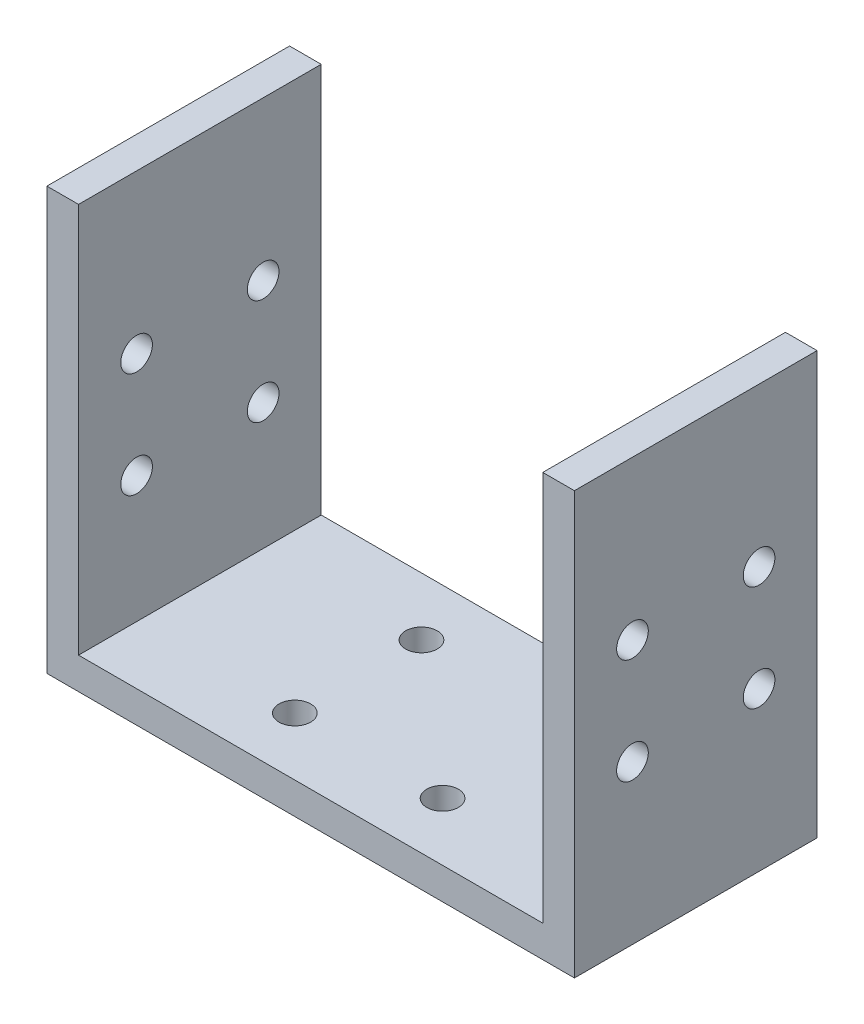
from build123d import *

# Parameters (mm, degrees)
SKETCH1_W               = 50
SKETCH1_H               = 23
BOSS_EXTRUDE1_DEPTH     = 40
SHELL1_T                = -3
CUT_EXTRUDE1_REACH      = 50.552
SKETCH2_R               = 1.5
CUT_EXTRUDE2_DEPTH      = 66.055745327
CUT_EXTRUDE2_DEPTH_BACK = 66.055745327
SKETCH3_R               = 1.5


with BuildPart() as part:
    # Sketch1 → Boss-Extrude1 (new body)
    with BuildSketch(Plane(origin=(0, 0, 0), x_dir=(1, 0, 0), z_dir=(0, 1, 0))):
        Rectangle(SKETCH1_W, SKETCH1_H)
    extrude(amount=BOSS_EXTRUDE1_DEPTH)

    # Shell1
    shell1_openings = [part.faces().sort_by_distance(p)[0] for p in [
        (0, 40, 0),
        (0, 20, 11.5),
        (0, 20, -11.5),
    ]]
    offset(amount=SHELL1_T, openings=shell1_openings, kind=Kind.INTERSECTION)

    # Sketch2 → Cut-Extrude1 (cut, up to next)
    with BuildSketch(Plane.XZ, mode=Mode.PRIVATE) as cut_extrude1_sk1:
        with Locations(Location((7, 6, 0), (0, 0, 270))):
            Circle(SKETCH2_R)
    cut_extrude1_tool1 = extrude(cut_extrude1_sk1.sketch, amount=-CUT_EXTRUDE1_REACH, mode=Mode.PRIVATE) & part.part
    # Sketch2 → Cut-Extrude1 (cut, up to next)
    with BuildSketch(Plane.XZ, mode=Mode.PRIVATE) as cut_extrude1_sk2:
        with Locations(Location((7, -6, 0), (0, 0, 270))):
            Circle(SKETCH2_R)
    cut_extrude1_tool2 = extrude(cut_extrude1_sk2.sketch, amount=-CUT_EXTRUDE1_REACH, mode=Mode.PRIVATE) & part.part
    # Sketch2 → Cut-Extrude1 (cut, up to next)
    with BuildSketch(Plane.XZ, mode=Mode.PRIVATE) as cut_extrude1_sk3:
        with Locations(Location((-7, -6, 0), (0, 0, 270))):
            Circle(SKETCH2_R)
    cut_extrude1_tool3 = extrude(cut_extrude1_sk3.sketch, amount=-CUT_EXTRUDE1_REACH, mode=Mode.PRIVATE) & part.part
    # Sketch2 → Cut-Extrude1 (cut, up to next)
    with BuildSketch(Plane.XZ, mode=Mode.PRIVATE) as cut_extrude1_sk4:
        with Locations(Location((-7, 6, 0), (0, 0, 270))):
            Circle(SKETCH2_R)
    cut_extrude1_tool4 = extrude(cut_extrude1_sk4.sketch, amount=-CUT_EXTRUDE1_REACH, mode=Mode.PRIVATE) & part.part
    add(cut_extrude1_tool1.solids().sort_by_distance((7, 0, 6))[0], mode=Mode.SUBTRACT)
    add(cut_extrude1_tool2.solids().sort_by_distance((7, 0, -6))[0], mode=Mode.SUBTRACT)
    add(cut_extrude1_tool3.solids().sort_by_distance((-7, 0, -6))[0], mode=Mode.SUBTRACT)
    add(cut_extrude1_tool4.solids().sort_by_distance((-7, 0, 6))[0], mode=Mode.SUBTRACT)

    # Sketch3 → Cut-Extrude2 (cut, two sides: drawn at the far end of the back side and taken through both)
    with BuildSketch(Plane(origin=(25, 0, 0), x_dir=(0, 0, -1), z_dir=(1, 0, 0)).offset(-CUT_EXTRUDE2_DEPTH_BACK)):
        with Locations((-6, 15)):
            Circle(SKETCH3_R)
        with Locations((6, 15)):
            Circle(SKETCH3_R)
        with Locations((6, 25)):
            Circle(SKETCH3_R)
        with Locations((-6, 25)):
            Circle(SKETCH3_R)
    extrude(amount=CUT_EXTRUDE2_DEPTH + CUT_EXTRUDE2_DEPTH_BACK, mode=Mode.SUBTRACT)


solid = part.part
